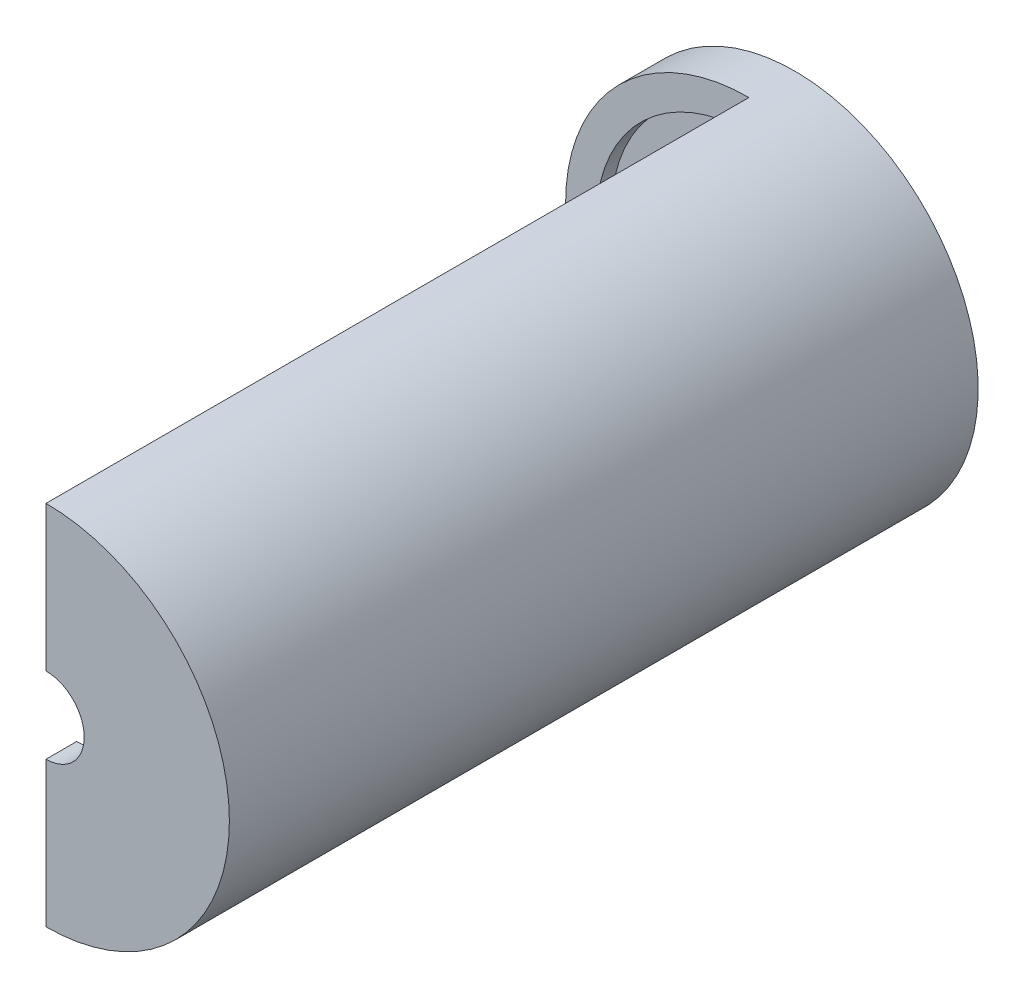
ISO-10303-21;
HEADER;
FILE_DESCRIPTION(('STEP AP214'),'2;1');
FILE_NAME('part.step','',(''),(''),'','','');
FILE_SCHEMA(('AUTOMOTIVE_DESIGN { 1 0 10303 214 1 1 1 1 }'));
ENDSEC;
DATA;
#1=APPLICATION_CONTEXT('core data for automotive mechanical design processes');
#2=APPLICATION_PROTOCOL_DEFINITION('international standard','automotive_design',2000,#1);
#3=PRODUCT_CONTEXT('',#1,'mechanical');
#4=PRODUCT('Part','Part','',(#3));
#5=PRODUCT_RELATED_PRODUCT_CATEGORY('part','',(#4));
#6=PRODUCT_DEFINITION_FORMATION('','',#4);
#7=PRODUCT_DEFINITION_CONTEXT('part definition',#1,'design');
#8=PRODUCT_DEFINITION('design','',#6,#7);
#9=PRODUCT_DEFINITION_SHAPE('','',#8);
#10=(LENGTH_UNIT() NAMED_UNIT(*) SI_UNIT(.MILLI.,.METRE.));
#11=(NAMED_UNIT(*) PLANE_ANGLE_UNIT() SI_UNIT($,.RADIAN.));
#12=(NAMED_UNIT(*) SI_UNIT($,.STERADIAN.) SOLID_ANGLE_UNIT());
#13=UNCERTAINTY_MEASURE_WITH_UNIT(LENGTH_MEASURE(1.E-05),#10,'distance_accuracy_value','');
#14=(GEOMETRIC_REPRESENTATION_CONTEXT(3) GLOBAL_UNCERTAINTY_ASSIGNED_CONTEXT((#13)) GLOBAL_UNIT_ASSIGNED_CONTEXT((#10,
#11,#12)) REPRESENTATION_CONTEXT('',''));
#15=CARTESIAN_POINT('',(0.,0.,0.));
#16=DIRECTION('',(0.,0.,1.));
#17=DIRECTION('',(1.,0.,0.));
#18=AXIS2_PLACEMENT_3D('',#15,#16,#17);
#19=CARTESIAN_POINT('',(0.,0.,45.));
#20=DIRECTION('',(0.,0.,-1.));
#21=DIRECTION('',(-1.,0.,0.));
#22=AXIS2_PLACEMENT_3D('',#19,#20,#21);
#23=CYLINDRICAL_SURFACE('',#22,12.);
#24=CARTESIAN_POINT('',(0.,0.,-2.));
#25=DIRECTION('',(0.,0.,-1.));
#26=DIRECTION('',(-1.,0.,0.));
#27=AXIS2_PLACEMENT_3D('',#24,#25,#26);
#28=CIRCLE('',#27,12.);
#29=CARTESIAN_POINT('',(-12.,0.,-2.));
#30=VERTEX_POINT('',#29);
#31=EDGE_CURVE('E123',#30,#30,#28,.T.);
#32=ORIENTED_EDGE('',*,*,#31,.F.);
#33=EDGE_LOOP('',(#32));
#34=FACE_BOUND('',#33,.T.);
#35=CARTESIAN_POINT('',(0.,0.,47.));
#36=DIRECTION('',(0.,0.,1.));
#37=DIRECTION('',(1.,0.,0.));
#38=AXIS2_PLACEMENT_3D('',#35,#36,#37);
#39=CIRCLE('',#38,12.);
#40=CARTESIAN_POINT('',(0.,-12.,47.));
#41=VERTEX_POINT('',#40);
#42=CARTESIAN_POINT('',(0.,12.,47.));
#43=VERTEX_POINT('',#42);
#44=EDGE_CURVE('E105',#41,#43,#39,.T.);
#45=ORIENTED_EDGE('',*,*,#44,.F.);
#46=DIRECTION('',(0.,0.,-1.));
#47=VECTOR('',#46,1.);
#48=CARTESIAN_POINT('',(0.,-12.,45.));
#49=LINE('',#48,#47);
#50=CARTESIAN_POINT('',(0.,-12.,0.999999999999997));
#51=VERTEX_POINT('',#50);
#52=EDGE_CURVE('E61',#41,#51,#49,.T.);
#53=ORIENTED_EDGE('',*,*,#52,.T.);
#54=CARTESIAN_POINT('',(0.,0.,1.00000000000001));
#55=DIRECTION('',(0.,0.,-1.));
#56=DIRECTION('',(0.,1.,0.));
#57=AXIS2_PLACEMENT_3D('',#54,#55,#56);
#58=CIRCLE('',#57,12.);
#59=CARTESIAN_POINT('',(0.,12.,1.));
#60=VERTEX_POINT('',#59);
#61=EDGE_CURVE('E91',#51,#60,#58,.T.);
#62=ORIENTED_EDGE('',*,*,#61,.T.);
#63=DIRECTION('',(0.,0.,-1.));
#64=VECTOR('',#63,1.);
#65=CARTESIAN_POINT('',(0.,12.,45.));
#66=LINE('',#65,#64);
#67=EDGE_CURVE('E146',#60,#43,#66,.F.);
#68=ORIENTED_EDGE('',*,*,#67,.T.);
#69=EDGE_LOOP('',(#45,#53,#62,#68));
#70=FACE_BOUND('',#69,.T.);
#71=ADVANCED_FACE('F39',(#34,#70),#23,.T.);
#72=CARTESIAN_POINT('',(0.,0.,-2.));
#73=DIRECTION('',(0.,0.,-1.));
#74=DIRECTION('',(-1.,0.,0.));
#75=AXIS2_PLACEMENT_3D('',#72,#73,#74);
#76=PLANE('',#75);
#77=ORIENTED_EDGE('',*,*,#31,.T.);
#78=EDGE_LOOP('',(#77));
#79=FACE_BOUND('',#78,.T.);
#80=ADVANCED_FACE('F167',(#79),#76,.T.);
#81=CARTESIAN_POINT('',(0.,0.,47.));
#82=DIRECTION('',(0.,0.,1.));
#83=DIRECTION('',(1.,0.,0.));
#84=AXIS2_PLACEMENT_3D('',#81,#82,#83);
#85=PLANE('',#84);
#86=DIRECTION('',(0.,1.,0.));
#87=VECTOR('',#86,1.);
#88=CARTESIAN_POINT('',(0.,0.,47.));
#89=LINE('',#88,#87);
#90=CARTESIAN_POINT('',(0.,-2.5,47.));
#91=VERTEX_POINT('',#90);
#92=EDGE_CURVE('E106',#41,#91,#89,.T.);
#93=ORIENTED_EDGE('',*,*,#92,.F.);
#94=ORIENTED_EDGE('',*,*,#44,.T.);
#95=CARTESIAN_POINT('',(0.,2.5,47.));
#96=VERTEX_POINT('',#95);
#97=EDGE_CURVE('E110',#96,#43,#89,.T.);
#98=ORIENTED_EDGE('',*,*,#97,.F.);
#99=CARTESIAN_POINT('',(0.,0.,47.));
#100=DIRECTION('',(0.,0.,1.));
#101=DIRECTION('',(1.,0.,0.));
#102=AXIS2_PLACEMENT_3D('',#99,#100,#101);
#103=CIRCLE('',#102,2.5);
#104=EDGE_CURVE('E114',#91,#96,#103,.T.);
#105=ORIENTED_EDGE('',*,*,#104,.F.);
#106=EDGE_LOOP('',(#93,#94,#98,#105));
#107=FACE_BOUND('',#106,.T.);
#108=ADVANCED_FACE('F150',(#107),#85,.T.);
#109=CARTESIAN_POINT('',(0.,0.,45.));
#110=DIRECTION('',(0.,0.,1.));
#111=DIRECTION('',(1.,0.,0.));
#112=AXIS2_PLACEMENT_3D('',#109,#110,#111);
#113=PLANE('',#112);
#114=CARTESIAN_POINT('',(0.,0.,45.));
#115=DIRECTION('',(0.,0.,1.));
#116=DIRECTION('',(1.,0.,0.));
#117=AXIS2_PLACEMENT_3D('',#114,#115,#116);
#118=CIRCLE('',#117,10.);
#119=CARTESIAN_POINT('',(0.,-10.,45.));
#120=VERTEX_POINT('',#119);
#121=CARTESIAN_POINT('',(0.,10.,45.));
#122=VERTEX_POINT('',#121);
#123=EDGE_CURVE('E120',#120,#122,#118,.T.);
#124=ORIENTED_EDGE('',*,*,#123,.F.);
#125=DIRECTION('',(0.,1.,0.));
#126=VECTOR('',#125,1.);
#127=CARTESIAN_POINT('',(0.,0.,45.));
#128=LINE('',#127,#126);
#129=CARTESIAN_POINT('',(0.,-2.5,45.));
#130=VERTEX_POINT('',#129);
#131=EDGE_CURVE('E144',#120,#130,#128,.T.);
#132=ORIENTED_EDGE('',*,*,#131,.T.);
#133=CARTESIAN_POINT('',(0.,0.,45.));
#134=DIRECTION('',(0.,0.,1.));
#135=DIRECTION('',(1.,0.,0.));
#136=AXIS2_PLACEMENT_3D('',#133,#134,#135);
#137=CIRCLE('',#136,2.5);
#138=CARTESIAN_POINT('',(0.,2.5,45.));
#139=VERTEX_POINT('',#138);
#140=EDGE_CURVE('E97',#130,#139,#137,.T.);
#141=ORIENTED_EDGE('',*,*,#140,.T.);
#142=EDGE_CURVE('E101',#139,#122,#128,.T.);
#143=ORIENTED_EDGE('',*,*,#142,.T.);
#144=EDGE_LOOP('',(#124,#132,#141,#143));
#145=FACE_BOUND('',#144,.T.);
#146=ADVANCED_FACE('F139',(#145),#113,.F.);
#147=CARTESIAN_POINT('',(0.,0.,47.));
#148=DIRECTION('',(0.,0.,-1.));
#149=DIRECTION('',(-1.,0.,0.));
#150=AXIS2_PLACEMENT_3D('',#147,#148,#149);
#151=CYLINDRICAL_SURFACE('',#150,2.5);
#152=DIRECTION('',(0.,0.,-1.));
#153=VECTOR('',#152,1.);
#154=CARTESIAN_POINT('',(0.,-2.5,47.));
#155=LINE('',#154,#153);
#156=EDGE_CURVE('E108',#91,#130,#155,.T.);
#157=ORIENTED_EDGE('',*,*,#156,.F.);
#158=ORIENTED_EDGE('',*,*,#104,.T.);
#159=DIRECTION('',(0.,0.,-1.));
#160=VECTOR('',#159,1.);
#161=CARTESIAN_POINT('',(0.,2.5,47.));
#162=LINE('',#161,#160);
#163=EDGE_CURVE('E142',#139,#96,#162,.F.);
#164=ORIENTED_EDGE('',*,*,#163,.F.);
#165=ORIENTED_EDGE('',*,*,#140,.F.);
#166=EDGE_LOOP('',(#157,#158,#164,#165));
#167=FACE_BOUND('',#166,.T.);
#168=ADVANCED_FACE('F153',(#167),#151,.F.);
#169=CARTESIAN_POINT('',(0.,0.,0.));
#170=DIRECTION('',(0.,0.,-1.));
#171=DIRECTION('',(-1.,0.,0.));
#172=AXIS2_PLACEMENT_3D('',#169,#170,#171);
#173=PLANE('',#172);
#174=CARTESIAN_POINT('',(0.,0.,0.));
#175=DIRECTION('',(0.,0.,1.));
#176=DIRECTION('',(1.,0.,0.));
#177=AXIS2_PLACEMENT_3D('',#174,#175,#176);
#178=CIRCLE('',#177,10.);
#179=CARTESIAN_POINT('',(10.,0.,0.));
#180=VERTEX_POINT('',#179);
#181=EDGE_CURVE('E126',#180,#180,#178,.T.);
#182=ORIENTED_EDGE('',*,*,#181,.T.);
#183=EDGE_LOOP('',(#182));
#184=FACE_BOUND('',#183,.T.);
#185=ADVANCED_FACE('F155',(#184),#173,.F.);
#186=CARTESIAN_POINT('',(0.,0.,45.));
#187=DIRECTION('',(0.,0.,-1.));
#188=DIRECTION('',(-1.,0.,0.));
#189=AXIS2_PLACEMENT_3D('',#186,#187,#188);
#190=CYLINDRICAL_SURFACE('',#189,10.);
#191=DIRECTION('',(0.,0.,-1.));
#192=VECTOR('',#191,1.);
#193=CARTESIAN_POINT('',(0.,-10.,45.));
#194=LINE('',#193,#192);
#195=CARTESIAN_POINT('',(0.,-10.,0.999999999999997));
#196=VERTEX_POINT('',#195);
#197=EDGE_CURVE('E12',#120,#196,#194,.T.);
#198=ORIENTED_EDGE('',*,*,#197,.F.);
#199=ORIENTED_EDGE('',*,*,#123,.T.);
#200=DIRECTION('',(0.,0.,-1.));
#201=VECTOR('',#200,1.);
#202=CARTESIAN_POINT('',(0.,10.,45.));
#203=LINE('',#202,#201);
#204=CARTESIAN_POINT('',(0.,10.,0.999999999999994));
#205=VERTEX_POINT('',#204);
#206=EDGE_CURVE('E129',#205,#122,#203,.F.);
#207=ORIENTED_EDGE('',*,*,#206,.F.);
#208=CARTESIAN_POINT('',(0.,0.,1.00000000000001));
#209=DIRECTION('',(0.,0.,-1.));
#210=DIRECTION('',(0.,1.,0.));
#211=AXIS2_PLACEMENT_3D('',#208,#209,#210);
#212=CIRCLE('',#211,10.);
#213=EDGE_CURVE('E46',#196,#205,#212,.T.);
#214=ORIENTED_EDGE('',*,*,#213,.F.);
#215=EDGE_LOOP('',(#198,#199,#207,#214));
#216=FACE_BOUND('',#215,.T.);
#217=ORIENTED_EDGE('',*,*,#181,.F.);
#218=EDGE_LOOP('',(#217));
#219=FACE_BOUND('',#218,.T.);
#220=ADVANCED_FACE('F132',(#216,#219),#190,.F.);
#221=CARTESIAN_POINT('',(-12.,17.8981463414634,1.));
#222=DIRECTION('',(0.,0.,-1.));
#223=DIRECTION('',(0.,1.,0.));
#224=AXIS2_PLACEMENT_3D('',#221,#222,#223);
#225=PLANE('',#224);
#226=DIRECTION('',(0.,1.,0.));
#227=VECTOR('',#226,1.);
#228=CARTESIAN_POINT('',(0.,17.8981463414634,1.));
#229=LINE('',#228,#227);
#230=EDGE_CURVE('E93',#51,#196,#229,.T.);
#231=ORIENTED_EDGE('',*,*,#230,.T.);
#232=ORIENTED_EDGE('',*,*,#213,.T.);
#233=EDGE_CURVE('E53',#205,#60,#229,.T.);
#234=ORIENTED_EDGE('',*,*,#233,.T.);
#235=ORIENTED_EDGE('',*,*,#61,.F.);
#236=EDGE_LOOP('',(#231,#232,#234,#235));
#237=FACE_BOUND('',#236,.T.);
#238=ADVANCED_FACE('F92',(#237),#225,.F.);
#239=CARTESIAN_POINT('',(0.,-21.4384390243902,53.3176585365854));
#240=DIRECTION('',(1.,0.,0.));
#241=DIRECTION('',(0.,0.,-1.));
#242=AXIS2_PLACEMENT_3D('',#239,#240,#241);
#243=PLANE('',#242);
#244=ORIENTED_EDGE('',*,*,#92,.T.);
#245=ORIENTED_EDGE('',*,*,#156,.T.);
#246=ORIENTED_EDGE('',*,*,#131,.F.);
#247=ORIENTED_EDGE('',*,*,#197,.T.);
#248=ORIENTED_EDGE('',*,*,#230,.F.);
#249=ORIENTED_EDGE('',*,*,#52,.F.);
#250=EDGE_LOOP('',(#244,#245,#246,#247,#248,#249));
#251=FACE_BOUND('',#250,.T.);
#252=ADVANCED_FACE('F99',(#251),#243,.F.);
#253=ORIENTED_EDGE('',*,*,#233,.F.);
#254=ORIENTED_EDGE('',*,*,#206,.T.);
#255=ORIENTED_EDGE('',*,*,#142,.F.);
#256=ORIENTED_EDGE('',*,*,#163,.T.);
#257=ORIENTED_EDGE('',*,*,#97,.T.);
#258=ORIENTED_EDGE('',*,*,#67,.F.);
#259=EDGE_LOOP('',(#253,#254,#255,#256,#257,#258));
#260=FACE_BOUND('',#259,.T.);
#261=ADVANCED_FACE('F136',(#260),#243,.F.);
#262=CLOSED_SHELL('',(#71,#80,#108,#146,#168,#185,#220,#238,#252,#261));
#263=MANIFOLD_SOLID_BREP('B2',#262);
#264=ADVANCED_BREP_SHAPE_REPRESENTATION('',(#18,#263),#14);
#265=SHAPE_DEFINITION_REPRESENTATION(#9,#264);
ENDSEC;
END-ISO-10303-21;
